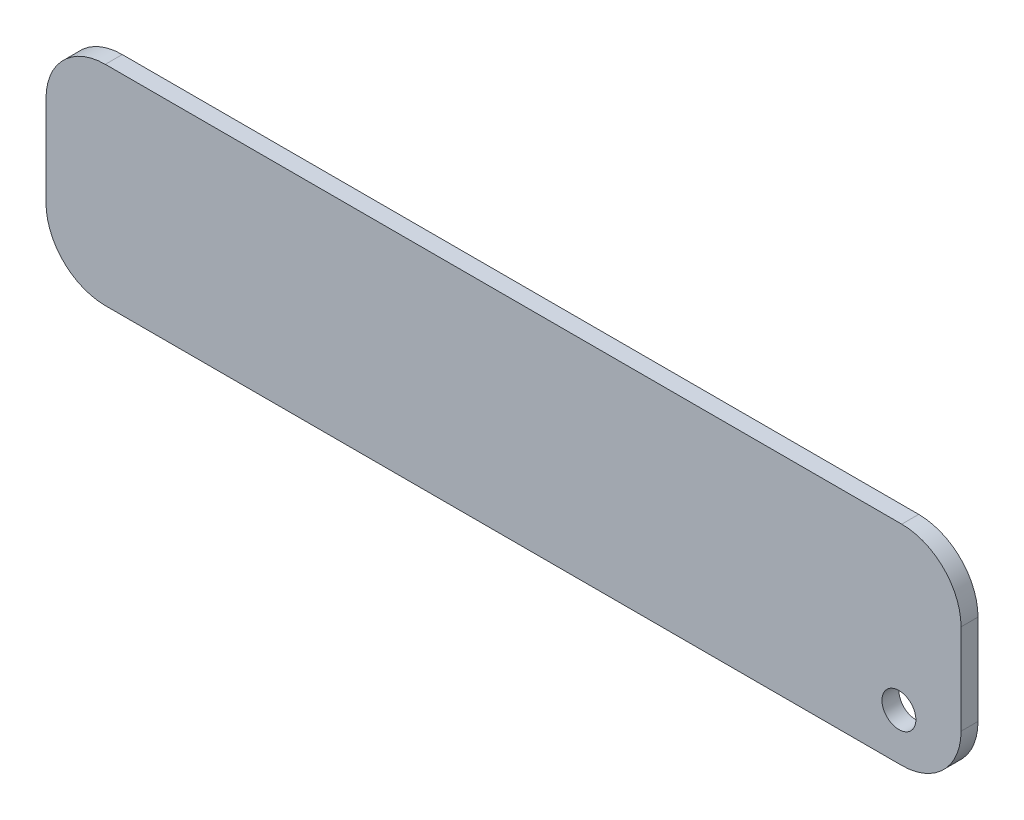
from build123d import *

# Parameters (mm, degrees)
EXTRUDE_1_DEPTH     = 3
SKETCH_2_R          = 3
CUT_EXTRUDE_1_DEPTH = 84.139942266


with BuildPart() as part:
    # Sketch 1 → Extrude 1 (new body)
    with BuildSketch(Plane.XY):
        with BuildLine():
            Line((-70.5, 18.5), (70.5, 18.5))
            ThreePointArc((70.5, 18.5), (77.924621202, 15.424621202), (81, 8))
            Line((81, 8), (81, -8))
            ThreePointArc((81, -8), (77.924621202, -15.424621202), (70.5, -18.5))
            Line((70.5, -18.5), (-70.5, -18.5))
            ThreePointArc((-70.5, -18.5), (-77.924621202, -15.424621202), (-81, -8))
            Line((-81, -8), (-81, 8))
            ThreePointArc((-81, 8), (-77.924621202, 15.424621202), (-70.5, 18.5))
        make_face()
    extrude(amount=EXTRUDE_1_DEPTH)

    # Sketch 2 → Cut-Extrude 1 (cut, through all)
    with BuildSketch(Plane.XY.offset(3)):
        with Locations((70, -10.25)):
            Circle(SKETCH_2_R)
    extrude(amount=-CUT_EXTRUDE_1_DEPTH, mode=Mode.SUBTRACT)


solid = part.part
